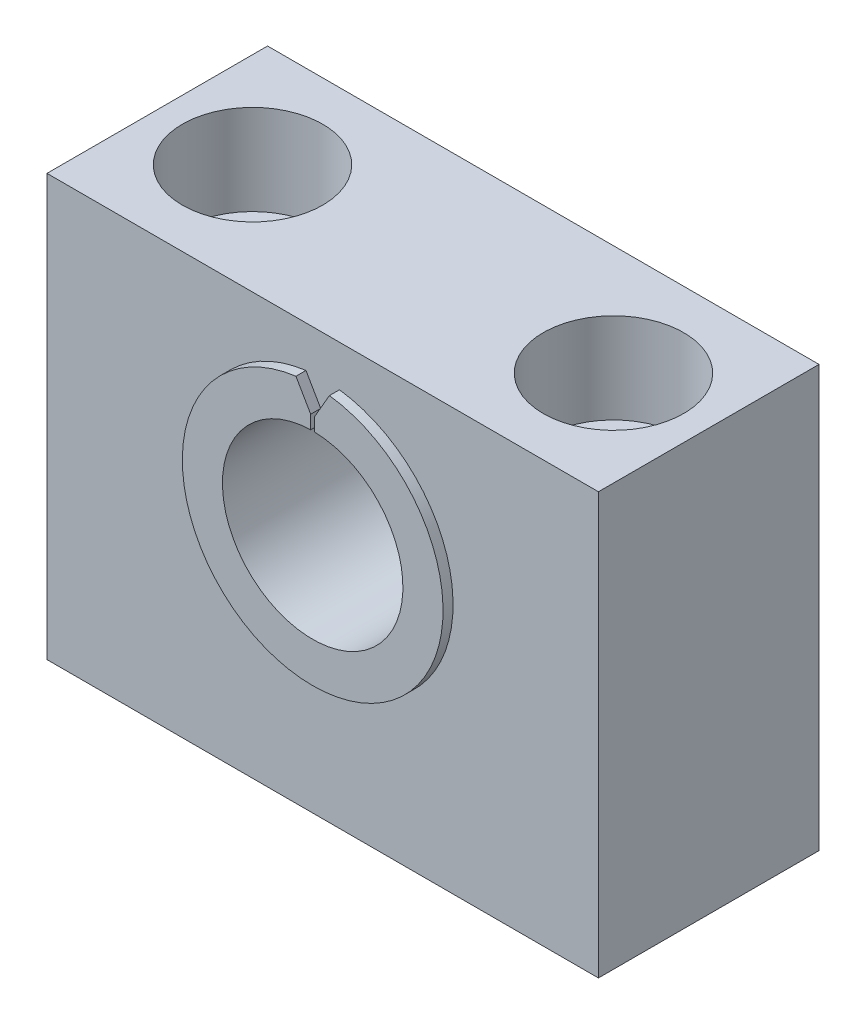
ISO-10303-21;
HEADER;
FILE_DESCRIPTION(('STEP AP214'),'2;1');
FILE_NAME('part.step','',(''),(''),'','','');
FILE_SCHEMA(('AUTOMOTIVE_DESIGN { 1 0 10303 214 1 1 1 1 }'));
ENDSEC;
DATA;
#1=APPLICATION_CONTEXT('core data for automotive mechanical design processes');
#2=APPLICATION_PROTOCOL_DEFINITION('international standard','automotive_design',2000,#1);
#3=PRODUCT_CONTEXT('',#1,'mechanical');
#4=PRODUCT('Part','Part','',(#3));
#5=PRODUCT_RELATED_PRODUCT_CATEGORY('part','',(#4));
#6=PRODUCT_DEFINITION_FORMATION('','',#4);
#7=PRODUCT_DEFINITION_CONTEXT('part definition',#1,'design');
#8=PRODUCT_DEFINITION('design','',#6,#7);
#9=PRODUCT_DEFINITION_SHAPE('','',#8);
#10=(LENGTH_UNIT() NAMED_UNIT(*) SI_UNIT(.MILLI.,.METRE.));
#11=(NAMED_UNIT(*) PLANE_ANGLE_UNIT() SI_UNIT($,.RADIAN.));
#12=(NAMED_UNIT(*) SI_UNIT($,.STERADIAN.) SOLID_ANGLE_UNIT());
#13=UNCERTAINTY_MEASURE_WITH_UNIT(LENGTH_MEASURE(1.E-05),#10,'distance_accuracy_value','');
#14=(GEOMETRIC_REPRESENTATION_CONTEXT(3) GLOBAL_UNCERTAINTY_ASSIGNED_CONTEXT((#13)) GLOBAL_UNIT_ASSIGNED_CONTEXT((#10,
#11,#12)) REPRESENTATION_CONTEXT('',''));
#15=CARTESIAN_POINT('',(0.,0.,0.));
#16=DIRECTION('',(0.,0.,1.));
#17=DIRECTION('',(1.,0.,0.));
#18=AXIS2_PLACEMENT_3D('',#15,#16,#17);
#19=CARTESIAN_POINT('',(0.,25.,-9.));
#20=DIRECTION('',(0.,0.,-1.));
#21=DIRECTION('',(0.,1.,0.));
#22=AXIS2_PLACEMENT_3D('',#19,#20,#21);
#23=CYLINDRICAL_SURFACE('',#22,9.);
#24=CARTESIAN_POINT('',(0.,25.,-9.));
#25=DIRECTION('',(0.,0.,1.));
#26=DIRECTION('',(-1.,0.,0.));
#27=AXIS2_PLACEMENT_3D('',#24,#25,#26);
#28=CIRCLE('',#27,9.);
#29=CARTESIAN_POINT('',(-0.199999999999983,33.9977775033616,-9.));
#30=VERTEX_POINT('',#29);
#31=CARTESIAN_POINT('',(0.200000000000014,33.9977775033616,-9.));
#32=VERTEX_POINT('',#31);
#33=EDGE_CURVE('E379',#30,#32,#28,.T.);
#34=ORIENTED_EDGE('',*,*,#33,.F.);
#35=DIRECTION('',(0.,0.,-1.));
#36=VECTOR('',#35,1.);
#37=CARTESIAN_POINT('',(-0.199999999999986,33.9977775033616,-9.));
#38=LINE('',#37,#36);
#39=CARTESIAN_POINT('',(-0.200000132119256,33.9977775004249,12.));
#40=VERTEX_POINT('',#39);
#41=EDGE_CURVE('E322',#40,#30,#38,.T.);
#42=ORIENTED_EDGE('',*,*,#41,.F.);
#43=CARTESIAN_POINT('',(0.,25.,12.));
#44=DIRECTION('',(0.,0.,-1.));
#45=DIRECTION('',(1.,0.,0.));
#46=AXIS2_PLACEMENT_3D('',#43,#44,#45);
#47=CIRCLE('',#46,9.);
#48=CARTESIAN_POINT('',(0.200000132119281,33.9977775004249,12.));
#49=VERTEX_POINT('',#48);
#50=EDGE_CURVE('E293',#49,#40,#47,.T.);
#51=ORIENTED_EDGE('',*,*,#50,.F.);
#52=DIRECTION('',(0.,0.,1.));
#53=VECTOR('',#52,1.);
#54=CARTESIAN_POINT('',(0.200000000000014,33.9977775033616,-9.));
#55=LINE('',#54,#53);
#56=EDGE_CURVE('E324',#32,#49,#55,.T.);
#57=ORIENTED_EDGE('',*,*,#56,.F.);
#58=EDGE_LOOP('',(#34,#42,#51,#57));
#59=FACE_BOUND('',#58,.T.);
#60=ADVANCED_FACE('F14',(#59),#23,.F.);
#61=CARTESIAN_POINT('',(-0.199999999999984,35.346410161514,-9.));
#62=DIRECTION('',(-1.,0.,0.));
#63=DIRECTION('',(0.,0.,1.));
#64=AXIS2_PLACEMENT_3D('',#61,#62,#63);
#65=PLANE('',#64);
#66=DIRECTION('',(0.,0.,1.));
#67=VECTOR('',#66,1.);
#68=CARTESIAN_POINT('',(-0.199999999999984,34.99799979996,-9.));
#69=LINE('',#68,#67);
#70=CARTESIAN_POINT('',(-0.200000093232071,34.997999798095,-9.));
#71=VERTEX_POINT('',#70);
#72=CARTESIAN_POINT('',(-0.200000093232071,34.997999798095,11.));
#73=VERTEX_POINT('',#72);
#74=EDGE_CURVE('E223',#71,#73,#69,.T.);
#75=ORIENTED_EDGE('',*,*,#74,.T.);
#76=DIRECTION('',(-2.67592747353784E-07,-0.999999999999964,0.));
#77=VECTOR('',#76,1.);
#78=CARTESIAN_POINT('',(-0.199999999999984,35.346410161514,11.));
#79=LINE('',#78,#77);
#80=CARTESIAN_POINT('',(-0.199999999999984,35.346410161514,11.));
#81=VERTEX_POINT('',#80);
#82=EDGE_CURVE('E235',#81,#73,#79,.T.);
#83=ORIENTED_EDGE('',*,*,#82,.F.);
#84=DIRECTION('',(0.,0.,1.));
#85=VECTOR('',#84,1.);
#86=CARTESIAN_POINT('',(-0.199999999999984,35.346410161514,-9.));
#87=LINE('',#86,#85);
#88=CARTESIAN_POINT('',(-0.199999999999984,35.346410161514,12.));
#89=VERTEX_POINT('',#88);
#90=EDGE_CURVE('E298',#81,#89,#87,.T.);
#91=ORIENTED_EDGE('',*,*,#90,.T.);
#92=DIRECTION('',(0.,-1.,0.));
#93=VECTOR('',#92,1.);
#94=CARTESIAN_POINT('',(-0.199999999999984,35.346410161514,12.));
#95=LINE('',#94,#93);
#96=CARTESIAN_POINT('',(-0.199999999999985,34.4978945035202,12.));
#97=VERTEX_POINT('',#96);
#98=EDGE_CURVE('E289',#89,#97,#95,.T.);
#99=ORIENTED_EDGE('',*,*,#98,.T.);
#100=DIRECTION('',(7.4690738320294E-09,1.,0.));
#101=VECTOR('',#100,1.);
#102=CARTESIAN_POINT('',(-0.200000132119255,33.9977775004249,12.));
#103=LINE('',#102,#101);
#104=EDGE_CURVE('E286',#40,#97,#103,.T.);
#105=ORIENTED_EDGE('',*,*,#104,.F.);
#106=ORIENTED_EDGE('',*,*,#41,.T.);
#107=DIRECTION('',(0.,-1.,0.));
#108=VECTOR('',#107,1.);
#109=CARTESIAN_POINT('',(-0.199999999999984,35.346410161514,-9.));
#110=LINE('',#109,#108);
#111=CARTESIAN_POINT('',(-0.199999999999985,34.8159775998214,-9.));
#112=VERTEX_POINT('',#111);
#113=EDGE_CURVE('E328',#112,#30,#110,.T.);
#114=ORIENTED_EDGE('',*,*,#113,.F.);
#115=DIRECTION('',(5.12201735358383E-07,-0.999999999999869,0.));
#116=VECTOR('',#115,1.);
#117=CARTESIAN_POINT('',(-0.200000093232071,34.997999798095,-9.));
#118=LINE('',#117,#116);
#119=EDGE_CURVE('E383',#71,#112,#118,.T.);
#120=ORIENTED_EDGE('',*,*,#119,.F.);
#121=EDGE_LOOP('',(#75,#83,#91,#99,#105,#106,#114,#120));
#122=FACE_BOUND('',#121,.T.);
#123=ADVANCED_FACE('F156',(#122),#65,.F.);
#124=CARTESIAN_POINT('',(0.2,25.,-9.));
#125=DIRECTION('',(1.,0.,0.));
#126=DIRECTION('',(0.,0.,-1.));
#127=AXIS2_PLACEMENT_3D('',#124,#125,#126);
#128=PLANE('',#127);
#129=DIRECTION('',(-2.6759274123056E-07,0.999999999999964,0.));
#130=VECTOR('',#129,1.);
#131=CARTESIAN_POINT('',(0.2000000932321,34.997999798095,11.));
#132=LINE('',#131,#130);
#133=CARTESIAN_POINT('',(0.2000000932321,34.997999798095,11.));
#134=VERTEX_POINT('',#133);
#135=CARTESIAN_POINT('',(0.200000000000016,35.346410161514,11.));
#136=VERTEX_POINT('',#135);
#137=EDGE_CURVE('E106',#134,#136,#132,.T.);
#138=ORIENTED_EDGE('',*,*,#137,.F.);
#139=DIRECTION('',(0.,0.,-1.));
#140=VECTOR('',#139,1.);
#141=CARTESIAN_POINT('',(0.200000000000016,34.99799979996,-9.));
#142=LINE('',#141,#140);
#143=CARTESIAN_POINT('',(0.2000000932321,34.997999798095,-9.));
#144=VERTEX_POINT('',#143);
#145=EDGE_CURVE('E226',#134,#144,#142,.T.);
#146=ORIENTED_EDGE('',*,*,#145,.T.);
#147=DIRECTION('',(5.12201730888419E-07,0.999999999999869,0.));
#148=VECTOR('',#147,1.);
#149=CARTESIAN_POINT('',(0.200000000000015,34.8159775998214,-9.));
#150=LINE('',#149,#148);
#151=CARTESIAN_POINT('',(0.200000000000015,34.8159775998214,-9.));
#152=VERTEX_POINT('',#151);
#153=EDGE_CURVE('E394',#152,#144,#150,.T.);
#154=ORIENTED_EDGE('',*,*,#153,.F.);
#155=DIRECTION('',(0.,1.,0.));
#156=VECTOR('',#155,1.);
#157=CARTESIAN_POINT('',(0.2,25.,-9.));
#158=LINE('',#157,#156);
#159=EDGE_CURVE('E332',#32,#152,#158,.T.);
#160=ORIENTED_EDGE('',*,*,#159,.F.);
#161=ORIENTED_EDGE('',*,*,#56,.T.);
#162=DIRECTION('',(7.4690873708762E-09,-1.,0.));
#163=VECTOR('',#162,1.);
#164=CARTESIAN_POINT('',(0.200000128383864,34.4978945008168,12.));
#165=LINE('',#164,#163);
#166=CARTESIAN_POINT('',(0.200000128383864,34.4978945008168,12.));
#167=VERTEX_POINT('',#166);
#168=EDGE_CURVE('E378',#167,#49,#165,.T.);
#169=ORIENTED_EDGE('',*,*,#168,.F.);
#170=DIRECTION('',(0.,1.,0.));
#171=VECTOR('',#170,1.);
#172=CARTESIAN_POINT('',(0.2,25.,12.));
#173=LINE('',#172,#171);
#174=CARTESIAN_POINT('',(0.200000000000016,35.346410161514,12.));
#175=VERTEX_POINT('',#174);
#176=EDGE_CURVE('E24',#167,#175,#173,.T.);
#177=ORIENTED_EDGE('',*,*,#176,.T.);
#178=DIRECTION('',(0.,0.,1.));
#179=VECTOR('',#178,1.);
#180=CARTESIAN_POINT('',(0.200000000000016,35.346410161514,-9.));
#181=LINE('',#180,#179);
#182=EDGE_CURVE('E295',#136,#175,#181,.T.);
#183=ORIENTED_EDGE('',*,*,#182,.F.);
#184=EDGE_LOOP('',(#138,#146,#154,#160,#161,#169,#177,#183));
#185=FACE_BOUND('',#184,.T.);
#186=ADVANCED_FACE('F162',(#185),#128,.F.);
#187=CARTESIAN_POINT('',(0.,34.3,-9.));
#188=DIRECTION('',(0.,0.,-1.));
#189=DIRECTION('',(-1.,0.,0.));
#190=AXIS2_PLACEMENT_3D('',#187,#188,#189);
#191=PLANE('',#190);
#192=ORIENTED_EDGE('',*,*,#159,.T.);
#193=ORIENTED_EDGE('',*,*,#153,.T.);
#194=CARTESIAN_POINT('',(0.,25.,-9.));
#195=DIRECTION('',(0.,0.,-1.));
#196=DIRECTION('',(-1.,0.,0.));
#197=AXIS2_PLACEMENT_3D('',#194,#195,#196);
#198=CIRCLE('',#197,10.);
#199=EDGE_CURVE('E391',#144,#71,#198,.T.);
#200=ORIENTED_EDGE('',*,*,#199,.T.);
#201=ORIENTED_EDGE('',*,*,#119,.T.);
#202=ORIENTED_EDGE('',*,*,#113,.T.);
#203=ORIENTED_EDGE('',*,*,#33,.T.);
#204=EDGE_LOOP('',(#192,#193,#200,#201,#202,#203));
#205=FACE_BOUND('',#204,.T.);
#206=ADVANCED_FACE('F168',(#205),#191,.T.);
#207=CARTESIAN_POINT('',(-1.93984108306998,38.359903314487,-9.));
#208=DIRECTION('',(-0.866025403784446,-0.499999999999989,0.));
#209=DIRECTION('',(-0.499999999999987,0.866025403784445,0.));
#210=AXIS2_PLACEMENT_3D('',#207,#208,#209);
#211=PLANE('',#210);
#212=DIRECTION('',(0.499999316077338,-0.866025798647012,0.));
#213=VECTOR('',#212,1.);
#214=CARTESIAN_POINT('',(-0.286419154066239,35.4960928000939,11.));
#215=LINE('',#214,#213);
#216=CARTESIAN_POINT('',(-0.286419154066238,35.4960928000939,11.));
#217=VERTEX_POINT('',#216);
#218=EDGE_CURVE('E376',#217,#81,#215,.T.);
#219=ORIENTED_EDGE('',*,*,#218,.F.);
#220=DIRECTION('',(-0.499999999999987,0.866025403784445,0.));
#221=VECTOR('',#220,1.);
#222=CARTESIAN_POINT('',(-0.216506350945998,35.375,11.));
#223=LINE('',#222,#221);
#224=CARTESIAN_POINT('',(-1.66987298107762,37.8923048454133,11.));
#225=VERTEX_POINT('',#224);
#226=EDGE_CURVE('E343',#217,#225,#223,.T.);
#227=ORIENTED_EDGE('',*,*,#226,.T.);
#228=DIRECTION('',(0.,0.,1.));
#229=VECTOR('',#228,1.);
#230=CARTESIAN_POINT('',(-1.66987298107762,37.8923048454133,-9.));
#231=LINE('',#230,#229);
#232=CARTESIAN_POINT('',(-1.66987298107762,37.8923048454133,12.));
#233=VERTEX_POINT('',#232);
#234=EDGE_CURVE('E356',#225,#233,#231,.T.);
#235=ORIENTED_EDGE('',*,*,#234,.T.);
#236=DIRECTION('',(0.499999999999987,-0.866025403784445,0.));
#237=VECTOR('',#236,1.);
#238=CARTESIAN_POINT('',(-1.93984108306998,38.359903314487,12.));
#239=LINE('',#238,#237);
#240=EDGE_CURVE('E299',#233,#89,#239,.T.);
#241=ORIENTED_EDGE('',*,*,#240,.T.);
#242=ORIENTED_EDGE('',*,*,#90,.F.);
#243=EDGE_LOOP('',(#219,#227,#235,#241,#242));
#244=FACE_BOUND('',#243,.T.);
#245=ADVANCED_FACE('F171',(#244),#211,.F.);
#246=CARTESIAN_POINT('',(0.,38.,12.));
#247=DIRECTION('',(0.,0.,1.));
#248=DIRECTION('',(1.,0.,0.));
#249=AXIS2_PLACEMENT_3D('',#246,#247,#248);
#250=PLANE('',#249);
#251=DIRECTION('',(0.499999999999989,0.866025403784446,0.));
#252=VECTOR('',#251,1.);
#253=CARTESIAN_POINT('',(0.200000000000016,35.346410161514,12.));
#254=LINE('',#253,#252);
#255=CARTESIAN_POINT('',(1.66987298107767,37.8923048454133,12.));
#256=VERTEX_POINT('',#255);
#257=EDGE_CURVE('E9',#175,#256,#254,.T.);
#258=ORIENTED_EDGE('',*,*,#257,.F.);
#259=ORIENTED_EDGE('',*,*,#176,.F.);
#260=ORIENTED_EDGE('',*,*,#168,.T.);
#261=ORIENTED_EDGE('',*,*,#50,.T.);
#262=ORIENTED_EDGE('',*,*,#104,.T.);
#263=ORIENTED_EDGE('',*,*,#98,.F.);
#264=ORIENTED_EDGE('',*,*,#240,.F.);
#265=CARTESIAN_POINT('',(0.,25.,12.));
#266=DIRECTION('',(0.,0.,-1.));
#267=DIRECTION('',(-1.,0.,0.));
#268=AXIS2_PLACEMENT_3D('',#265,#266,#267);
#269=CIRCLE('',#268,13.);
#270=EDGE_CURVE('E303',#256,#233,#269,.T.);
#271=ORIENTED_EDGE('',*,*,#270,.F.);
#272=EDGE_LOOP('',(#258,#259,#260,#261,#262,#263,#264,#271));
#273=FACE_BOUND('',#272,.T.);
#274=ADVANCED_FACE('F179',(#273),#250,.T.);
#275=CARTESIAN_POINT('',(0.200000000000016,35.346410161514,-9.));
#276=DIRECTION('',(0.866025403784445,-0.499999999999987,0.));
#277=DIRECTION('',(-0.499999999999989,-0.866025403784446,0.));
#278=AXIS2_PLACEMENT_3D('',#275,#276,#277);
#279=PLANE('',#278);
#280=DIRECTION('',(0.499999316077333,0.866025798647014,0.));
#281=VECTOR('',#280,1.);
#282=CARTESIAN_POINT('',(0.200000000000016,35.346410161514,11.));
#283=LINE('',#282,#281);
#284=CARTESIAN_POINT('',(0.286419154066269,35.4960928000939,11.));
#285=VERTEX_POINT('',#284);
#286=EDGE_CURVE('E33',#136,#285,#283,.T.);
#287=ORIENTED_EDGE('',*,*,#286,.F.);
#288=ORIENTED_EDGE('',*,*,#182,.T.);
#289=ORIENTED_EDGE('',*,*,#257,.T.);
#290=DIRECTION('',(0.,0.,-1.));
#291=VECTOR('',#290,1.);
#292=CARTESIAN_POINT('',(1.66987298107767,37.8923048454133,-9.));
#293=LINE('',#292,#291);
#294=CARTESIAN_POINT('',(1.66987298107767,37.8923048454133,11.));
#295=VERTEX_POINT('',#294);
#296=EDGE_CURVE('E361',#256,#295,#293,.T.);
#297=ORIENTED_EDGE('',*,*,#296,.T.);
#298=DIRECTION('',(-0.499999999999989,-0.866025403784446,0.));
#299=VECTOR('',#298,1.);
#300=CARTESIAN_POINT('',(0.21650635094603,35.375,11.));
#301=LINE('',#300,#299);
#302=EDGE_CURVE('E347',#295,#285,#301,.T.);
#303=ORIENTED_EDGE('',*,*,#302,.T.);
#304=EDGE_LOOP('',(#287,#288,#289,#297,#303));
#305=FACE_BOUND('',#304,.T.);
#306=ADVANCED_FACE('F177',(#305),#279,.F.);
#307=CARTESIAN_POINT('',(0.,25.,-9.));
#308=DIRECTION('',(0.,0.,-1.));
#309=DIRECTION('',(0.,1.,0.));
#310=AXIS2_PLACEMENT_3D('',#307,#308,#309);
#311=CYLINDRICAL_SURFACE('',#310,13.);
#312=ORIENTED_EDGE('',*,*,#296,.F.);
#313=ORIENTED_EDGE('',*,*,#270,.T.);
#314=ORIENTED_EDGE('',*,*,#234,.F.);
#315=CARTESIAN_POINT('',(0.,25.,11.));
#316=DIRECTION('',(0.,0.,-1.));
#317=DIRECTION('',(-1.,0.,0.));
#318=AXIS2_PLACEMENT_3D('',#315,#316,#317);
#319=CIRCLE('',#318,13.);
#320=EDGE_CURVE('E351',#295,#225,#319,.T.);
#321=ORIENTED_EDGE('',*,*,#320,.F.);
#322=EDGE_LOOP('',(#312,#313,#314,#321));
#323=FACE_BOUND('',#322,.T.);
#324=ADVANCED_FACE('F173',(#323),#311,.T.);
#325=CARTESIAN_POINT('',(18.,33.,0.));
#326=DIRECTION('',(0.,1.,0.));
#327=DIRECTION('',(0.,0.,1.));
#328=AXIS2_PLACEMENT_3D('',#325,#326,#327);
#329=PLANE('',#328);
#330=CARTESIAN_POINT('',(18.,33.,0.));
#331=DIRECTION('',(0.,1.,0.));
#332=DIRECTION('',(0.,0.,1.));
#333=AXIS2_PLACEMENT_3D('',#330,#331,#332);
#334=CIRCLE('',#333,4.5);
#335=CARTESIAN_POINT('',(18.,33.,4.5));
#336=VERTEX_POINT('',#335);
#337=EDGE_CURVE('E107',#336,#336,#334,.T.);
#338=ORIENTED_EDGE('',*,*,#337,.F.);
#339=EDGE_LOOP('',(#338));
#340=FACE_BOUND('',#339,.T.);
#341=CARTESIAN_POINT('',(18.,33.,0.));
#342=DIRECTION('',(0.,1.,0.));
#343=DIRECTION('',(0.,0.,1.));
#344=AXIS2_PLACEMENT_3D('',#341,#342,#343);
#345=CIRCLE('',#344,7.);
#346=CARTESIAN_POINT('',(18.,33.,7.));
#347=VERTEX_POINT('',#346);
#348=EDGE_CURVE('E110',#347,#347,#345,.T.);
#349=ORIENTED_EDGE('',*,*,#348,.T.);
#350=EDGE_LOOP('',(#349));
#351=FACE_BOUND('',#350,.T.);
#352=ADVANCED_FACE('F176',(#340,#351),#329,.T.);
#353=CARTESIAN_POINT('',(-18.,33.,0.));
#354=DIRECTION('',(0.,1.,0.));
#355=DIRECTION('',(0.,0.,1.));
#356=AXIS2_PLACEMENT_3D('',#353,#354,#355);
#357=PLANE('',#356);
#358=CARTESIAN_POINT('',(-18.,33.,0.));
#359=DIRECTION('',(0.,1.,0.));
#360=DIRECTION('',(0.,0.,1.));
#361=AXIS2_PLACEMENT_3D('',#358,#359,#360);
#362=CIRCLE('',#361,4.5);
#363=CARTESIAN_POINT('',(-18.,33.,4.5));
#364=VERTEX_POINT('',#363);
#365=EDGE_CURVE('E18',#364,#364,#362,.T.);
#366=ORIENTED_EDGE('',*,*,#365,.F.);
#367=EDGE_LOOP('',(#366));
#368=FACE_BOUND('',#367,.T.);
#369=CARTESIAN_POINT('',(-18.,33.,0.));
#370=DIRECTION('',(0.,1.,0.));
#371=DIRECTION('',(0.,0.,1.));
#372=AXIS2_PLACEMENT_3D('',#369,#370,#371);
#373=CIRCLE('',#372,7.);
#374=CARTESIAN_POINT('',(-18.,33.,7.));
#375=VERTEX_POINT('',#374);
#376=EDGE_CURVE('E539',#375,#375,#373,.T.);
#377=ORIENTED_EDGE('',*,*,#376,.T.);
#378=EDGE_LOOP('',(#377));
#379=FACE_BOUND('',#378,.T.);
#380=ADVANCED_FACE('F183',(#368,#379),#357,.T.);
#381=CARTESIAN_POINT('',(18.,33.,0.));
#382=DIRECTION('',(0.,1.,0.));
#383=DIRECTION('',(0.,0.,1.));
#384=AXIS2_PLACEMENT_3D('',#381,#382,#383);
#385=CYLINDRICAL_SURFACE('',#384,7.);
#386=ORIENTED_EDGE('',*,*,#348,.F.);
#387=EDGE_LOOP('',(#386));
#388=FACE_BOUND('',#387,.T.);
#389=CARTESIAN_POINT('',(18.,42.,0.));
#390=DIRECTION('',(0.,1.,0.));
#391=DIRECTION('',(0.,0.,1.));
#392=AXIS2_PLACEMENT_3D('',#389,#390,#391);
#393=CIRCLE('',#392,7.);
#394=CARTESIAN_POINT('',(18.,42.,7.));
#395=VERTEX_POINT('',#394);
#396=EDGE_CURVE('E117',#395,#395,#393,.T.);
#397=ORIENTED_EDGE('',*,*,#396,.T.);
#398=EDGE_LOOP('',(#397));
#399=FACE_BOUND('',#398,.T.);
#400=ADVANCED_FACE('F186',(#388,#399),#385,.F.);
#401=CARTESIAN_POINT('',(-18.,33.,0.));
#402=DIRECTION('',(0.,1.,0.));
#403=DIRECTION('',(0.,0.,1.));
#404=AXIS2_PLACEMENT_3D('',#401,#402,#403);
#405=CYLINDRICAL_SURFACE('',#404,7.);
#406=ORIENTED_EDGE('',*,*,#376,.F.);
#407=EDGE_LOOP('',(#406));
#408=FACE_BOUND('',#407,.T.);
#409=CARTESIAN_POINT('',(-18.,42.,0.));
#410=DIRECTION('',(0.,1.,0.));
#411=DIRECTION('',(0.,0.,1.));
#412=AXIS2_PLACEMENT_3D('',#409,#410,#411);
#413=CIRCLE('',#412,7.);
#414=CARTESIAN_POINT('',(-18.,42.,7.));
#415=VERTEX_POINT('',#414);
#416=EDGE_CURVE('E124',#415,#415,#413,.T.);
#417=ORIENTED_EDGE('',*,*,#416,.T.);
#418=EDGE_LOOP('',(#417));
#419=FACE_BOUND('',#418,.T.);
#420=ADVANCED_FACE('F188',(#408,#419),#405,.F.);
#421=CARTESIAN_POINT('',(18.,42.,0.));
#422=DIRECTION('',(0.,-1.,0.));
#423=DIRECTION('',(0.,0.,-1.));
#424=AXIS2_PLACEMENT_3D('',#421,#422,#423);
#425=CYLINDRICAL_SURFACE('',#424,4.5);
#426=CARTESIAN_POINT('',(18.,0.,0.));
#427=DIRECTION('',(0.,1.,0.));
#428=DIRECTION('',(0.,0.,1.));
#429=AXIS2_PLACEMENT_3D('',#426,#427,#428);
#430=CIRCLE('',#429,4.5);
#431=CARTESIAN_POINT('',(18.,0.,4.5));
#432=VERTEX_POINT('',#431);
#433=EDGE_CURVE('E96',#432,#432,#430,.T.);
#434=ORIENTED_EDGE('',*,*,#433,.F.);
#435=EDGE_LOOP('',(#434));
#436=FACE_BOUND('',#435,.T.);
#437=ORIENTED_EDGE('',*,*,#337,.T.);
#438=EDGE_LOOP('',(#437));
#439=FACE_BOUND('',#438,.T.);
#440=ADVANCED_FACE('F151',(#436,#439),#425,.F.);
#441=CARTESIAN_POINT('',(-18.,42.,0.));
#442=DIRECTION('',(0.,-1.,0.));
#443=DIRECTION('',(0.,0.,-1.));
#444=AXIS2_PLACEMENT_3D('',#441,#442,#443);
#445=CYLINDRICAL_SURFACE('',#444,4.5);
#446=CARTESIAN_POINT('',(-18.,0.,0.));
#447=DIRECTION('',(0.,1.,0.));
#448=DIRECTION('',(0.,0.,1.));
#449=AXIS2_PLACEMENT_3D('',#446,#447,#448);
#450=CIRCLE('',#449,4.5);
#451=CARTESIAN_POINT('',(-18.,0.,4.5));
#452=VERTEX_POINT('',#451);
#453=EDGE_CURVE('E92',#452,#452,#450,.T.);
#454=ORIENTED_EDGE('',*,*,#453,.F.);
#455=EDGE_LOOP('',(#454));
#456=FACE_BOUND('',#455,.T.);
#457=ORIENTED_EDGE('',*,*,#365,.T.);
#458=EDGE_LOOP('',(#457));
#459=FACE_BOUND('',#458,.T.);
#460=ADVANCED_FACE('F142',(#456,#459),#445,.F.);
#461=CARTESIAN_POINT('',(-27.5,42.,11.));
#462=DIRECTION('',(1.,0.,0.));
#463=DIRECTION('',(0.,0.,-1.));
#464=AXIS2_PLACEMENT_3D('',#461,#462,#463);
#465=PLANE('',#464);
#466=DIRECTION('',(0.,0.,1.));
#467=VECTOR('',#466,1.);
#468=CARTESIAN_POINT('',(-27.5,0.,11.));
#469=LINE('',#468,#467);
#470=CARTESIAN_POINT('',(-27.5,0.,-11.));
#471=VERTEX_POINT('',#470);
#472=CARTESIAN_POINT('',(-27.5,0.,11.));
#473=VERTEX_POINT('',#472);
#474=EDGE_CURVE('E63',#471,#473,#469,.T.);
#475=ORIENTED_EDGE('',*,*,#474,.T.);
#476=DIRECTION('',(0.,-1.,0.));
#477=VECTOR('',#476,1.);
#478=CARTESIAN_POINT('',(-27.5,42.,11.));
#479=LINE('',#478,#477);
#480=CARTESIAN_POINT('',(-27.5,42.,11.));
#481=VERTEX_POINT('',#480);
#482=EDGE_CURVE('E76',#481,#473,#479,.T.);
#483=ORIENTED_EDGE('',*,*,#482,.F.);
#484=DIRECTION('',(0.,0.,1.));
#485=VECTOR('',#484,1.);
#486=CARTESIAN_POINT('',(-27.5,42.,11.));
#487=LINE('',#486,#485);
#488=CARTESIAN_POINT('',(-27.5,42.,-11.));
#489=VERTEX_POINT('',#488);
#490=EDGE_CURVE('E133',#489,#481,#487,.T.);
#491=ORIENTED_EDGE('',*,*,#490,.F.);
#492=DIRECTION('',(0.,-1.,0.));
#493=VECTOR('',#492,1.);
#494=CARTESIAN_POINT('',(-27.5,42.,-11.));
#495=LINE('',#494,#493);
#496=EDGE_CURVE('E103',#489,#471,#495,.T.);
#497=ORIENTED_EDGE('',*,*,#496,.T.);
#498=EDGE_LOOP('',(#475,#483,#491,#497));
#499=FACE_BOUND('',#498,.T.);
#500=ADVANCED_FACE('F140',(#499),#465,.F.);
#501=CARTESIAN_POINT('',(0.,42.,0.));
#502=DIRECTION('',(0.,-1.,0.));
#503=DIRECTION('',(0.,0.,-1.));
#504=AXIS2_PLACEMENT_3D('',#501,#502,#503);
#505=PLANE('',#504);
#506=ORIENTED_EDGE('',*,*,#416,.F.);
#507=EDGE_LOOP('',(#506));
#508=FACE_BOUND('',#507,.T.);
#509=ORIENTED_EDGE('',*,*,#396,.F.);
#510=EDGE_LOOP('',(#509));
#511=FACE_BOUND('',#510,.T.);
#512=DIRECTION('',(0.,0.,-1.));
#513=VECTOR('',#512,1.);
#514=CARTESIAN_POINT('',(27.5,42.,11.));
#515=LINE('',#514,#513);
#516=CARTESIAN_POINT('',(27.5,42.,11.));
#517=VERTEX_POINT('',#516);
#518=CARTESIAN_POINT('',(27.5,42.,-11.));
#519=VERTEX_POINT('',#518);
#520=EDGE_CURVE('E79',#517,#519,#515,.T.);
#521=ORIENTED_EDGE('',*,*,#520,.T.);
#522=DIRECTION('',(-1.,0.,0.));
#523=VECTOR('',#522,1.);
#524=CARTESIAN_POINT('',(-27.5,42.,-11.));
#525=LINE('',#524,#523);
#526=EDGE_CURVE('E132',#519,#489,#525,.T.);
#527=ORIENTED_EDGE('',*,*,#526,.T.);
#528=ORIENTED_EDGE('',*,*,#490,.T.);
#529=DIRECTION('',(1.,0.,0.));
#530=VECTOR('',#529,1.);
#531=CARTESIAN_POINT('',(-27.5,42.,11.));
#532=LINE('',#531,#530);
#533=EDGE_CURVE('E86',#481,#517,#532,.T.);
#534=ORIENTED_EDGE('',*,*,#533,.T.);
#535=EDGE_LOOP('',(#521,#527,#528,#534));
#536=FACE_BOUND('',#535,.T.);
#537=ADVANCED_FACE('F136',(#508,#511,#536),#505,.F.);
#538=CARTESIAN_POINT('',(27.5,42.,11.));
#539=DIRECTION('',(-1.,0.,0.));
#540=DIRECTION('',(0.,0.,1.));
#541=AXIS2_PLACEMENT_3D('',#538,#539,#540);
#542=PLANE('',#541);
#543=DIRECTION('',(0.,0.,-1.));
#544=VECTOR('',#543,1.);
#545=CARTESIAN_POINT('',(27.5,0.,11.));
#546=LINE('',#545,#544);
#547=CARTESIAN_POINT('',(27.5,0.,11.));
#548=VERTEX_POINT('',#547);
#549=CARTESIAN_POINT('',(27.5,0.,-11.));
#550=VERTEX_POINT('',#549);
#551=EDGE_CURVE('E84',#548,#550,#546,.T.);
#552=ORIENTED_EDGE('',*,*,#551,.T.);
#553=DIRECTION('',(0.,-1.,0.));
#554=VECTOR('',#553,1.);
#555=CARTESIAN_POINT('',(27.5,42.,-11.));
#556=LINE('',#555,#554);
#557=EDGE_CURVE('E105',#519,#550,#556,.T.);
#558=ORIENTED_EDGE('',*,*,#557,.F.);
#559=ORIENTED_EDGE('',*,*,#520,.F.);
#560=DIRECTION('',(0.,-1.,0.));
#561=VECTOR('',#560,1.);
#562=CARTESIAN_POINT('',(27.5,42.,11.));
#563=LINE('',#562,#561);
#564=EDGE_CURVE('E74',#517,#548,#563,.T.);
#565=ORIENTED_EDGE('',*,*,#564,.T.);
#566=EDGE_LOOP('',(#552,#558,#559,#565));
#567=FACE_BOUND('',#566,.T.);
#568=ADVANCED_FACE('F16',(#567),#542,.F.);
#569=CARTESIAN_POINT('',(0.,0.,0.));
#570=DIRECTION('',(0.,-1.,0.));
#571=DIRECTION('',(0.,0.,-1.));
#572=AXIS2_PLACEMENT_3D('',#569,#570,#571);
#573=PLANE('',#572);
#574=ORIENTED_EDGE('',*,*,#453,.T.);
#575=EDGE_LOOP('',(#574));
#576=FACE_BOUND('',#575,.T.);
#577=ORIENTED_EDGE('',*,*,#551,.F.);
#578=DIRECTION('',(1.,0.,0.));
#579=VECTOR('',#578,1.);
#580=CARTESIAN_POINT('',(-27.5,0.,11.));
#581=LINE('',#580,#579);
#582=EDGE_CURVE('E69',#473,#548,#581,.T.);
#583=ORIENTED_EDGE('',*,*,#582,.F.);
#584=ORIENTED_EDGE('',*,*,#474,.F.);
#585=DIRECTION('',(-1.,0.,0.));
#586=VECTOR('',#585,1.);
#587=CARTESIAN_POINT('',(-27.5,0.,-11.));
#588=LINE('',#587,#586);
#589=EDGE_CURVE('E90',#550,#471,#588,.T.);
#590=ORIENTED_EDGE('',*,*,#589,.F.);
#591=EDGE_LOOP('',(#577,#583,#584,#590));
#592=FACE_BOUND('',#591,.T.);
#593=ORIENTED_EDGE('',*,*,#433,.T.);
#594=EDGE_LOOP('',(#593));
#595=FACE_BOUND('',#594,.T.);
#596=ADVANCED_FACE('F88',(#576,#592,#595),#573,.T.);
#597=CARTESIAN_POINT('',(-27.5,42.,11.));
#598=DIRECTION('',(0.,0.,-1.));
#599=DIRECTION('',(-1.,0.,0.));
#600=AXIS2_PLACEMENT_3D('',#597,#598,#599);
#601=PLANE('',#600);
#602=ORIENTED_EDGE('',*,*,#582,.T.);
#603=ORIENTED_EDGE('',*,*,#564,.F.);
#604=ORIENTED_EDGE('',*,*,#533,.F.);
#605=ORIENTED_EDGE('',*,*,#482,.T.);
#606=EDGE_LOOP('',(#602,#603,#604,#605));
#607=FACE_BOUND('',#606,.T.);
#608=ORIENTED_EDGE('',*,*,#218,.T.);
#609=ORIENTED_EDGE('',*,*,#82,.T.);
#610=CARTESIAN_POINT('',(0.,25.,11.));
#611=DIRECTION('',(0.,0.,1.));
#612=DIRECTION('',(1.,0.,0.));
#613=AXIS2_PLACEMENT_3D('',#610,#611,#612);
#614=CIRCLE('',#613,10.);
#615=EDGE_CURVE('E109',#134,#73,#614,.T.);
#616=ORIENTED_EDGE('',*,*,#615,.F.);
#617=ORIENTED_EDGE('',*,*,#137,.T.);
#618=ORIENTED_EDGE('',*,*,#286,.T.);
#619=ORIENTED_EDGE('',*,*,#302,.F.);
#620=ORIENTED_EDGE('',*,*,#320,.T.);
#621=ORIENTED_EDGE('',*,*,#226,.F.);
#622=EDGE_LOOP('',(#608,#609,#616,#617,#618,#619,#620,#621));
#623=FACE_BOUND('',#622,.T.);
#624=ADVANCED_FACE('F71',(#607,#623),#601,.F.);
#625=CARTESIAN_POINT('',(-27.5,42.,-11.));
#626=DIRECTION('',(0.,0.,1.));
#627=DIRECTION('',(1.,0.,0.));
#628=AXIS2_PLACEMENT_3D('',#625,#626,#627);
#629=PLANE('',#628);
#630=CARTESIAN_POINT('',(0.,25.,-11.));
#631=DIRECTION('',(0.,0.,1.));
#632=DIRECTION('',(1.,0.,0.));
#633=AXIS2_PLACEMENT_3D('',#630,#631,#632);
#634=CIRCLE('',#633,10.);
#635=CARTESIAN_POINT('',(10.,25.,-11.));
#636=VERTEX_POINT('',#635);
#637=EDGE_CURVE('E114',#636,#636,#634,.T.);
#638=ORIENTED_EDGE('',*,*,#637,.T.);
#639=EDGE_LOOP('',(#638));
#640=FACE_BOUND('',#639,.T.);
#641=ORIENTED_EDGE('',*,*,#589,.T.);
#642=ORIENTED_EDGE('',*,*,#496,.F.);
#643=ORIENTED_EDGE('',*,*,#526,.F.);
#644=ORIENTED_EDGE('',*,*,#557,.T.);
#645=EDGE_LOOP('',(#641,#642,#643,#644));
#646=FACE_BOUND('',#645,.T.);
#647=ADVANCED_FACE('F139',(#640,#646),#629,.F.);
#648=CARTESIAN_POINT('',(0.,25.,-11.));
#649=DIRECTION('',(0.,0.,1.));
#650=DIRECTION('',(1.,0.,0.));
#651=AXIS2_PLACEMENT_3D('',#648,#649,#650);
#652=CYLINDRICAL_SURFACE('',#651,10.);
#653=ORIENTED_EDGE('',*,*,#637,.F.);
#654=EDGE_LOOP('',(#653));
#655=FACE_BOUND('',#654,.T.);
#656=ORIENTED_EDGE('',*,*,#615,.T.);
#657=ORIENTED_EDGE('',*,*,#74,.F.);
#658=ORIENTED_EDGE('',*,*,#199,.F.);
#659=ORIENTED_EDGE('',*,*,#145,.F.);
#660=EDGE_LOOP('',(#656,#657,#658,#659));
#661=FACE_BOUND('',#660,.T.);
#662=ADVANCED_FACE('F198',(#655,#661),#652,.F.);
#663=CLOSED_SHELL('',(#60,#123,#186,#206,#245,#274,#306,#324,#352,#380,#400,#420,#440,#460,#500,
#537,#568,#596,#624,#647,#662));
#664=MANIFOLD_SOLID_BREP('B1',#663);
#665=ADVANCED_BREP_SHAPE_REPRESENTATION('',(#18,#664),#14);
#666=SHAPE_DEFINITION_REPRESENTATION(#9,#665);
ENDSEC;
END-ISO-10303-21;
